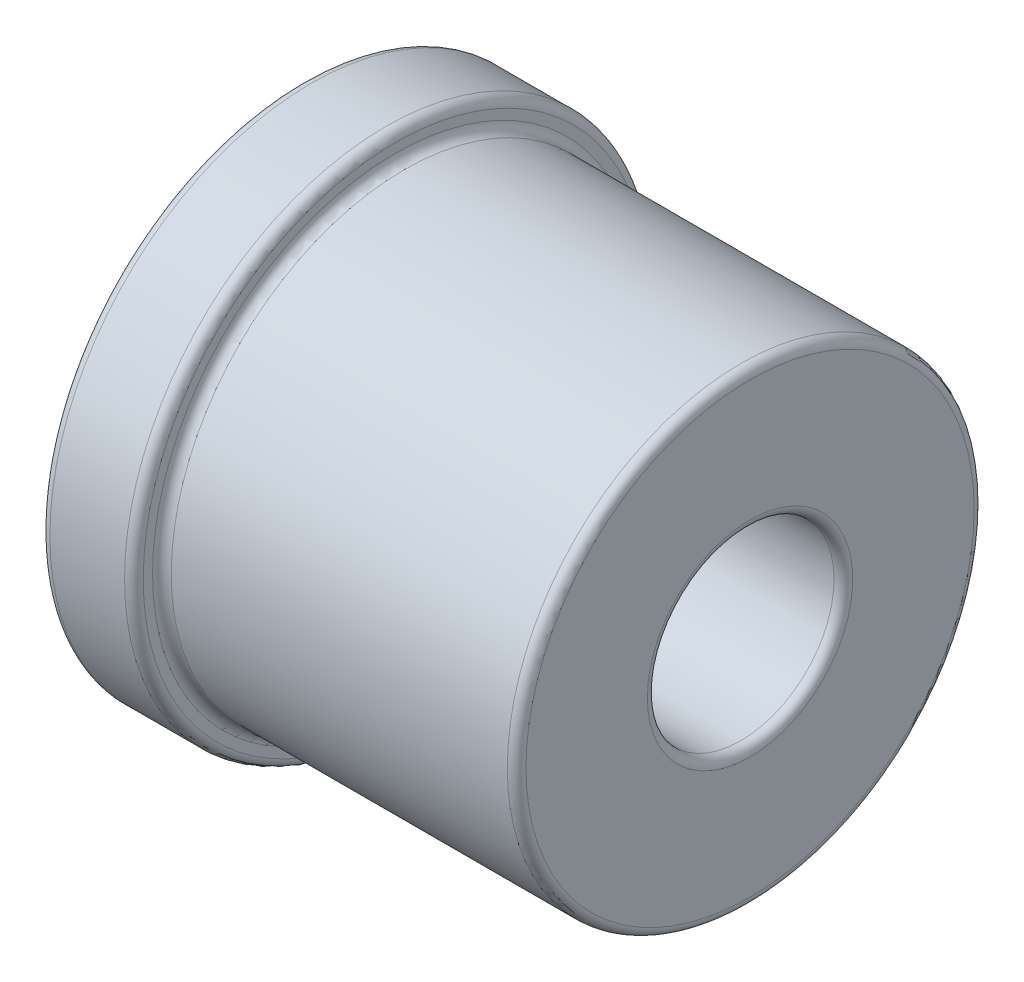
ISO-10303-21;
HEADER;
FILE_DESCRIPTION(('STEP AP214'),'2;1');
FILE_NAME('part.step','',(''),(''),'','','');
FILE_SCHEMA(('AUTOMOTIVE_DESIGN { 1 0 10303 214 1 1 1 1 }'));
ENDSEC;
DATA;
#1=APPLICATION_CONTEXT('core data for automotive mechanical design processes');
#2=APPLICATION_PROTOCOL_DEFINITION('international standard','automotive_design',2000,#1);
#3=PRODUCT_CONTEXT('',#1,'mechanical');
#4=PRODUCT('Part','Part','',(#3));
#5=PRODUCT_RELATED_PRODUCT_CATEGORY('part','',(#4));
#6=PRODUCT_DEFINITION_FORMATION('','',#4);
#7=PRODUCT_DEFINITION_CONTEXT('part definition',#1,'design');
#8=PRODUCT_DEFINITION('design','',#6,#7);
#9=PRODUCT_DEFINITION_SHAPE('','',#8);
#10=(LENGTH_UNIT() NAMED_UNIT(*) SI_UNIT(.MILLI.,.METRE.));
#11=(NAMED_UNIT(*) PLANE_ANGLE_UNIT() SI_UNIT($,.RADIAN.));
#12=(NAMED_UNIT(*) SI_UNIT($,.STERADIAN.) SOLID_ANGLE_UNIT());
#13=UNCERTAINTY_MEASURE_WITH_UNIT(LENGTH_MEASURE(1.E-05),#10,'distance_accuracy_value','');
#14=(GEOMETRIC_REPRESENTATION_CONTEXT(3) GLOBAL_UNCERTAINTY_ASSIGNED_CONTEXT((#13)) GLOBAL_UNIT_ASSIGNED_CONTEXT((#10,
#11,#12)) REPRESENTATION_CONTEXT('',''));
#15=CARTESIAN_POINT('',(0.,0.,0.));
#16=DIRECTION('',(0.,0.,1.));
#17=DIRECTION('',(1.,0.,0.));
#18=AXIS2_PLACEMENT_3D('',#15,#16,#17);
#19=CARTESIAN_POINT('',(-25.1168631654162,2.8,0.));
#20=DIRECTION('',(1.,0.,0.));
#21=DIRECTION('',(0.,0.,-1.));
#22=AXIS2_PLACEMENT_3D('',#19,#20,#21);
#23=PLANE('',#22);
#24=CARTESIAN_POINT('',(-25.1168631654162,0.,0.));
#25=DIRECTION('',(1.,0.,0.));
#26=DIRECTION('',(0.,0.,-1.));
#27=AXIS2_PLACEMENT_3D('',#24,#25,#26);
#28=CIRCLE('',#27,1.1);
#29=CARTESIAN_POINT('',(-25.1168631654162,0.,-1.1));
#30=VERTEX_POINT('',#29);
#31=EDGE_CURVE('E66',#30,#30,#28,.T.);
#32=ORIENTED_EDGE('',*,*,#31,.T.);
#33=EDGE_LOOP('',(#32));
#34=FACE_BOUND('',#33,.T.);
#35=CARTESIAN_POINT('',(-25.1168631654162,0.,0.));
#36=DIRECTION('',(1.,0.,0.));
#37=DIRECTION('',(0.,0.,-1.));
#38=AXIS2_PLACEMENT_3D('',#35,#36,#37);
#39=CIRCLE('',#38,2.7);
#40=CARTESIAN_POINT('',(-25.1168631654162,0.,-2.7));
#41=VERTEX_POINT('',#40);
#42=EDGE_CURVE('E69',#41,#41,#39,.F.);
#43=ORIENTED_EDGE('',*,*,#42,.T.);
#44=EDGE_LOOP('',(#43));
#45=FACE_BOUND('',#44,.T.);
#46=ADVANCED_FACE('F29',(#34,#45),#23,.F.);
#47=CARTESIAN_POINT('',(-20.3168631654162,2.5,0.));
#48=DIRECTION('',(-1.,0.,0.));
#49=DIRECTION('',(0.,0.,1.));
#50=AXIS2_PLACEMENT_3D('',#47,#48,#49);
#51=PLANE('',#50);
#52=CARTESIAN_POINT('',(-20.3168631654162,0.,0.));
#53=DIRECTION('',(-1.,0.,0.));
#54=DIRECTION('',(0.,0.,1.));
#55=AXIS2_PLACEMENT_3D('',#52,#53,#54);
#56=CIRCLE('',#55,2.4);
#57=CARTESIAN_POINT('',(-20.3168631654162,0.,2.4));
#58=VERTEX_POINT('',#57);
#59=EDGE_CURVE('E10',#58,#58,#56,.F.);
#60=ORIENTED_EDGE('',*,*,#59,.T.);
#61=EDGE_LOOP('',(#60));
#62=FACE_BOUND('',#61,.T.);
#63=CARTESIAN_POINT('',(-20.3168631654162,0.,0.));
#64=DIRECTION('',(-1.,0.,0.));
#65=DIRECTION('',(0.,0.,1.));
#66=AXIS2_PLACEMENT_3D('',#63,#64,#65);
#67=CIRCLE('',#66,1.1);
#68=CARTESIAN_POINT('',(-20.3168631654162,0.,1.1));
#69=VERTEX_POINT('',#68);
#70=EDGE_CURVE('E35',#69,#69,#67,.T.);
#71=ORIENTED_EDGE('',*,*,#70,.T.);
#72=EDGE_LOOP('',(#71));
#73=FACE_BOUND('',#72,.T.);
#74=ADVANCED_FACE('F92',(#62,#73),#51,.F.);
#75=CARTESIAN_POINT('',(-25.1168631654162,0.,0.));
#76=DIRECTION('',(-1.,0.,0.));
#77=DIRECTION('',(0.,0.,1.));
#78=AXIS2_PLACEMENT_3D('',#75,#76,#77);
#79=CYLINDRICAL_SURFACE('',#78,2.5);
#80=CARTESIAN_POINT('',(-24.0168631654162,0.,0.));
#81=DIRECTION('',(-1.,0.,0.));
#82=DIRECTION('',(0.,0.,1.));
#83=AXIS2_PLACEMENT_3D('',#80,#81,#82);
#84=CIRCLE('',#83,2.5);
#85=CARTESIAN_POINT('',(-24.0168631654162,0.,2.5));
#86=VERTEX_POINT('',#85);
#87=EDGE_CURVE('E39',#86,#86,#84,.F.);
#88=ORIENTED_EDGE('',*,*,#87,.T.);
#89=EDGE_LOOP('',(#88));
#90=FACE_BOUND('',#89,.T.);
#91=CARTESIAN_POINT('',(-20.4168631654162,0.,0.));
#92=DIRECTION('',(-1.,0.,0.));
#93=DIRECTION('',(0.,0.,1.));
#94=AXIS2_PLACEMENT_3D('',#91,#92,#93);
#95=CIRCLE('',#94,2.5);
#96=CARTESIAN_POINT('',(-20.4168631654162,0.,2.5));
#97=VERTEX_POINT('',#96);
#98=EDGE_CURVE('E43',#97,#97,#95,.T.);
#99=ORIENTED_EDGE('',*,*,#98,.T.);
#100=EDGE_LOOP('',(#99));
#101=FACE_BOUND('',#100,.T.);
#102=ADVANCED_FACE('F97',(#90,#101),#79,.T.);
#103=CARTESIAN_POINT('',(-24.1168631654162,2.8,0.));
#104=DIRECTION('',(-1.,0.,0.));
#105=DIRECTION('',(0.,0.,1.));
#106=AXIS2_PLACEMENT_3D('',#103,#104,#105);
#107=PLANE('',#106);
#108=CARTESIAN_POINT('',(-24.1168631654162,0.,0.));
#109=DIRECTION('',(-1.,0.,0.));
#110=DIRECTION('',(0.,0.,1.));
#111=AXIS2_PLACEMENT_3D('',#108,#109,#110);
#112=CIRCLE('',#111,2.6);
#113=CARTESIAN_POINT('',(-24.1168631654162,0.,2.6));
#114=VERTEX_POINT('',#113);
#115=EDGE_CURVE('E48',#114,#114,#112,.T.);
#116=ORIENTED_EDGE('',*,*,#115,.T.);
#117=EDGE_LOOP('',(#116));
#118=FACE_BOUND('',#117,.T.);
#119=CARTESIAN_POINT('',(-24.1168631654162,0.,0.));
#120=DIRECTION('',(-1.,0.,0.));
#121=DIRECTION('',(0.,0.,1.));
#122=AXIS2_PLACEMENT_3D('',#119,#120,#121);
#123=CIRCLE('',#122,2.7);
#124=CARTESIAN_POINT('',(-24.1168631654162,0.,2.7));
#125=VERTEX_POINT('',#124);
#126=EDGE_CURVE('E51',#125,#125,#123,.F.);
#127=ORIENTED_EDGE('',*,*,#126,.T.);
#128=EDGE_LOOP('',(#127));
#129=FACE_BOUND('',#128,.T.);
#130=ADVANCED_FACE('F103',(#118,#129),#107,.F.);
#131=CARTESIAN_POINT('',(-25.1168631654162,0.,0.));
#132=DIRECTION('',(-1.,0.,0.));
#133=DIRECTION('',(0.,0.,1.));
#134=AXIS2_PLACEMENT_3D('',#131,#132,#133);
#135=CYLINDRICAL_SURFACE('',#134,2.8);
#136=CARTESIAN_POINT('',(-25.0168631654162,0.,0.));
#137=DIRECTION('',(1.,0.,0.));
#138=DIRECTION('',(0.,0.,-1.));
#139=AXIS2_PLACEMENT_3D('',#136,#137,#138);
#140=CIRCLE('',#139,2.8);
#141=CARTESIAN_POINT('',(-25.0168631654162,0.,-2.8));
#142=VERTEX_POINT('',#141);
#143=EDGE_CURVE('E54',#142,#142,#140,.T.);
#144=ORIENTED_EDGE('',*,*,#143,.T.);
#145=EDGE_LOOP('',(#144));
#146=FACE_BOUND('',#145,.T.);
#147=CARTESIAN_POINT('',(-24.2168631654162,0.,0.));
#148=DIRECTION('',(-1.,0.,0.));
#149=DIRECTION('',(0.,0.,1.));
#150=AXIS2_PLACEMENT_3D('',#147,#148,#149);
#151=CIRCLE('',#150,2.8);
#152=CARTESIAN_POINT('',(-24.2168631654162,0.,2.8));
#153=VERTEX_POINT('',#152);
#154=EDGE_CURVE('E57',#153,#153,#151,.T.);
#155=ORIENTED_EDGE('',*,*,#154,.T.);
#156=EDGE_LOOP('',(#155));
#157=FACE_BOUND('',#156,.T.);
#158=ADVANCED_FACE('F109',(#146,#157),#135,.T.);
#159=CARTESIAN_POINT('',(-25.1168631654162,0.,0.));
#160=DIRECTION('',(1.,0.,0.));
#161=DIRECTION('',(0.,0.,-1.));
#162=AXIS2_PLACEMENT_3D('',#159,#160,#161);
#163=CYLINDRICAL_SURFACE('',#162,1.);
#164=CARTESIAN_POINT('',(-25.0168631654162,0.,0.));
#165=DIRECTION('',(1.,0.,0.));
#166=DIRECTION('',(0.,0.,-1.));
#167=AXIS2_PLACEMENT_3D('',#164,#165,#166);
#168=CIRCLE('',#167,1.);
#169=CARTESIAN_POINT('',(-25.0168631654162,0.,-1.));
#170=VERTEX_POINT('',#169);
#171=EDGE_CURVE('E60',#170,#170,#168,.F.);
#172=ORIENTED_EDGE('',*,*,#171,.T.);
#173=EDGE_LOOP('',(#172));
#174=FACE_BOUND('',#173,.T.);
#175=CARTESIAN_POINT('',(-20.4168631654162,0.,0.));
#176=DIRECTION('',(-1.,0.,0.));
#177=DIRECTION('',(0.,0.,1.));
#178=AXIS2_PLACEMENT_3D('',#175,#176,#177);
#179=CIRCLE('',#178,1.);
#180=CARTESIAN_POINT('',(-20.4168631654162,0.,1.));
#181=VERTEX_POINT('',#180);
#182=EDGE_CURVE('E63',#181,#181,#179,.F.);
#183=ORIENTED_EDGE('',*,*,#182,.T.);
#184=EDGE_LOOP('',(#183));
#185=FACE_BOUND('',#184,.T.);
#186=ADVANCED_FACE('F87',(#174,#185),#163,.F.);
#187=CARTESIAN_POINT('',(-25.0168631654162,0.,0.));
#188=DIRECTION('',(1.,0.,0.));
#189=DIRECTION('',(0.,0.,-1.));
#190=AXIS2_PLACEMENT_3D('',#187,#188,#189);
#191=TOROIDAL_SURFACE('',#190,1.1,0.1);
#192=ORIENTED_EDGE('',*,*,#171,.F.);
#193=EDGE_LOOP('',(#192));
#194=FACE_BOUND('',#193,.T.);
#195=ORIENTED_EDGE('',*,*,#31,.F.);
#196=EDGE_LOOP('',(#195));
#197=FACE_BOUND('',#196,.T.);
#198=ADVANCED_FACE('F77',(#194,#197),#191,.T.);
#199=CARTESIAN_POINT('',(-25.0168631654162,0.,0.));
#200=DIRECTION('',(1.,0.,0.));
#201=DIRECTION('',(0.,0.,-1.));
#202=AXIS2_PLACEMENT_3D('',#199,#200,#201);
#203=TOROIDAL_SURFACE('',#202,2.7,0.1);
#204=ORIENTED_EDGE('',*,*,#143,.F.);
#205=EDGE_LOOP('',(#204));
#206=FACE_BOUND('',#205,.T.);
#207=ORIENTED_EDGE('',*,*,#42,.F.);
#208=EDGE_LOOP('',(#207));
#209=FACE_BOUND('',#208,.T.);
#210=ADVANCED_FACE('F74',(#206,#209),#203,.T.);
#211=CARTESIAN_POINT('',(-24.0168631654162,0.,0.));
#212=DIRECTION('',(-1.,0.,0.));
#213=DIRECTION('',(0.,0.,1.));
#214=AXIS2_PLACEMENT_3D('',#211,#212,#213);
#215=TOROIDAL_SURFACE('',#214,2.6,0.1);
#216=ORIENTED_EDGE('',*,*,#87,.F.);
#217=EDGE_LOOP('',(#216));
#218=FACE_BOUND('',#217,.T.);
#219=ORIENTED_EDGE('',*,*,#115,.F.);
#220=EDGE_LOOP('',(#219));
#221=FACE_BOUND('',#220,.T.);
#222=ADVANCED_FACE('F76',(#218,#221),#215,.F.);
#223=CARTESIAN_POINT('',(-24.2168631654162,0.,0.));
#224=DIRECTION('',(-1.,0.,0.));
#225=DIRECTION('',(0.,0.,1.));
#226=AXIS2_PLACEMENT_3D('',#223,#224,#225);
#227=TOROIDAL_SURFACE('',#226,2.7,0.1);
#228=ORIENTED_EDGE('',*,*,#126,.F.);
#229=EDGE_LOOP('',(#228));
#230=FACE_BOUND('',#229,.T.);
#231=ORIENTED_EDGE('',*,*,#154,.F.);
#232=EDGE_LOOP('',(#231));
#233=FACE_BOUND('',#232,.T.);
#234=ADVANCED_FACE('F84',(#230,#233),#227,.T.);
#235=CARTESIAN_POINT('',(-20.4168631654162,0.,0.));
#236=DIRECTION('',(-1.,0.,0.));
#237=DIRECTION('',(0.,0.,1.));
#238=AXIS2_PLACEMENT_3D('',#235,#236,#237);
#239=TOROIDAL_SURFACE('',#238,2.4,0.1);
#240=ORIENTED_EDGE('',*,*,#59,.F.);
#241=EDGE_LOOP('',(#240));
#242=FACE_BOUND('',#241,.T.);
#243=ORIENTED_EDGE('',*,*,#98,.F.);
#244=EDGE_LOOP('',(#243));
#245=FACE_BOUND('',#244,.T.);
#246=ADVANCED_FACE('F124',(#242,#245),#239,.T.);
#247=CARTESIAN_POINT('',(-20.4168631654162,0.,0.));
#248=DIRECTION('',(-1.,0.,0.));
#249=DIRECTION('',(0.,0.,1.));
#250=AXIS2_PLACEMENT_3D('',#247,#248,#249);
#251=TOROIDAL_SURFACE('',#250,1.1,0.1);
#252=ORIENTED_EDGE('',*,*,#70,.F.);
#253=EDGE_LOOP('',(#252));
#254=FACE_BOUND('',#253,.T.);
#255=ORIENTED_EDGE('',*,*,#182,.F.);
#256=EDGE_LOOP('',(#255));
#257=FACE_BOUND('',#256,.T.);
#258=ADVANCED_FACE('F122',(#254,#257),#251,.T.);
#259=CLOSED_SHELL('',(#46,#74,#102,#130,#158,#186,#198,#210,#222,#234,#246,#258));
#260=MANIFOLD_SOLID_BREP('B2',#259);
#261=ADVANCED_BREP_SHAPE_REPRESENTATION('',(#18,#260),#14);
#262=SHAPE_DEFINITION_REPRESENTATION(#9,#261);
ENDSEC;
END-ISO-10303-21;
